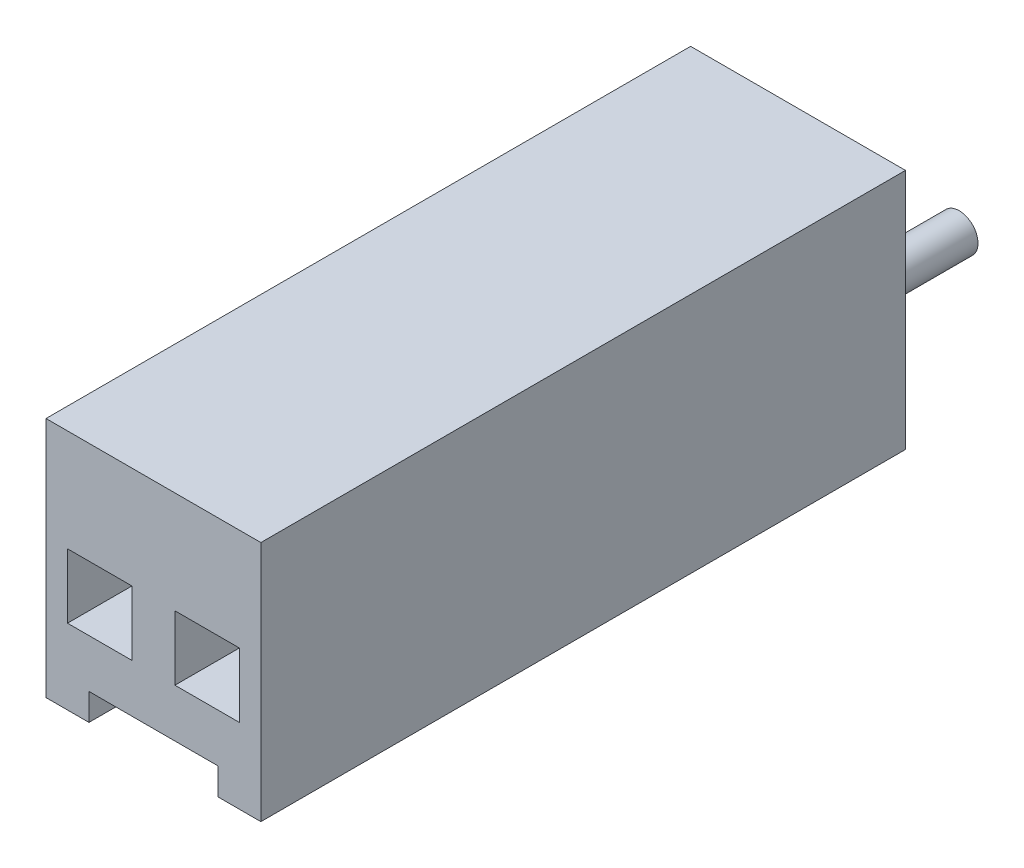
from build123d import *

# Parameters (mm, degrees)
SKETCH2_W           = 5.08
SKETCH2_H           = 5.715
BOSS_EXTRUDE2_DEPTH = 2.54
SKETCH3_W           = 2.54
SKETCH3_H           = 0.635
BOSS_EXTRUDE3_DEPTH = 7.62
SKETCH4_W           = 5.08
SKETCH4_H           = 5.08
BOSS_EXTRUDE4_DEPTH = 12.7
SKETCH5_R           = 0.4445
BOSS_EXTRUDE5_DEPTH = 2.54
SKETCH_2_W          = 1.016
SKETCH_2_H          = 12.7
EXTRUDE_1_DEPTH     = 0.635
SKETCH_3_W          = 1.524
SKETCH_3_H          = 1.524
CUT_EXTRUDE_1_DEPTH = 12.7


with BuildPart() as part:
    # Sketch2 → Boss-Extrude2 (new body)
    with BuildSketch(Plane.XY):
        with Locations((1.27, 0.3175)):
            Rectangle(SKETCH2_W, SKETCH2_H)
    extrude(amount=BOSS_EXTRUDE2_DEPTH)

    # Sketch3 → Boss-Extrude3 (add)
    with BuildSketch(Plane.XY.offset(2.54)):
        with Locations((1.27, -2.2225)):
            Rectangle(SKETCH3_W, SKETCH3_H)
    extrude(amount=BOSS_EXTRUDE3_DEPTH)

    # Sketch4 → Boss-Extrude4 (add)
    with BuildSketch(Plane.XY.offset(2.54)):
        with Locations((1.27, 0.635)):
            Rectangle(SKETCH4_W, SKETCH4_H)
    extrude(amount=BOSS_EXTRUDE4_DEPTH)

    # Sketch5 → Boss-Extrude5 (add)
    with BuildSketch(Plane(origin=(0, 0, 0), x_dir=(-1, 0, 0), z_dir=(0, 0, -1))):
        with Locations(Location((0, 0, 0), (0, 0, 180))):
            Circle(SKETCH5_R)
        with Locations(Location((-2.54, 0, 0), (0, 0, 180))):
            Circle(SKETCH5_R)
    extrude(amount=BOSS_EXTRUDE5_DEPTH)

    # Sketch 2 → Extrude 1 (add)
    with BuildSketch(Plane.XZ.offset(1.905)):
        with Locations((-0.762, 8.89)):
            Rectangle(SKETCH_2_W, SKETCH_2_H)
        with Locations((3.302, 8.89)):
            Rectangle(SKETCH_2_W, SKETCH_2_H)
    extrude(amount=EXTRUDE_1_DEPTH)

    # Sketch 3 → Cut-Extrude 1 (cut)
    with BuildSketch(Plane.XY.offset(15.24)):
        Rectangle(SKETCH_3_W, SKETCH_3_H)
        with Locations((2.54, 0)):
            Rectangle(SKETCH_3_W, SKETCH_3_H)
    extrude(amount=-CUT_EXTRUDE_1_DEPTH, mode=Mode.SUBTRACT)


solid = part.part
